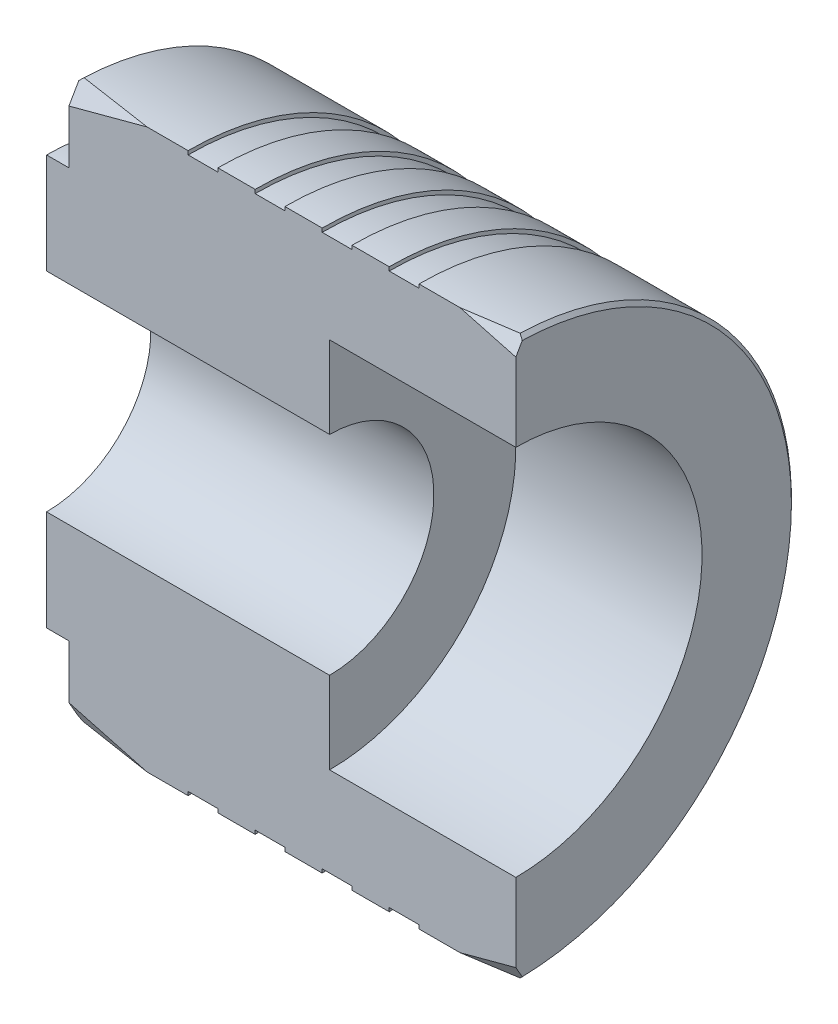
ISO-10303-21;
HEADER;
FILE_DESCRIPTION(('STEP AP214'),'2;1');
FILE_NAME('part.step','',(''),(''),'','','');
FILE_SCHEMA(('AUTOMOTIVE_DESIGN { 1 0 10303 214 1 1 1 1 }'));
ENDSEC;
DATA;
#1=APPLICATION_CONTEXT('core data for automotive mechanical design processes');
#2=APPLICATION_PROTOCOL_DEFINITION('international standard','automotive_design',2000,#1);
#3=PRODUCT_CONTEXT('',#1,'mechanical');
#4=PRODUCT('Part','Part','',(#3));
#5=PRODUCT_RELATED_PRODUCT_CATEGORY('part','',(#4));
#6=PRODUCT_DEFINITION_FORMATION('','',#4);
#7=PRODUCT_DEFINITION_CONTEXT('part definition',#1,'design');
#8=PRODUCT_DEFINITION('design','',#6,#7);
#9=PRODUCT_DEFINITION_SHAPE('','',#8);
#10=(LENGTH_UNIT() NAMED_UNIT(*) SI_UNIT(.MILLI.,.METRE.));
#11=(NAMED_UNIT(*) PLANE_ANGLE_UNIT() SI_UNIT($,.RADIAN.));
#12=(NAMED_UNIT(*) SI_UNIT($,.STERADIAN.) SOLID_ANGLE_UNIT());
#13=UNCERTAINTY_MEASURE_WITH_UNIT(LENGTH_MEASURE(1.E-05),#10,'distance_accuracy_value','');
#14=(GEOMETRIC_REPRESENTATION_CONTEXT(3) GLOBAL_UNCERTAINTY_ASSIGNED_CONTEXT((#13)) GLOBAL_UNIT_ASSIGNED_CONTEXT((#10,
#11,#12)) REPRESENTATION_CONTEXT('',''));
#15=CARTESIAN_POINT('',(0.,0.,0.));
#16=DIRECTION('',(0.,0.,1.));
#17=DIRECTION('',(1.,0.,0.));
#18=AXIS2_PLACEMENT_3D('',#15,#16,#17);
#19=CARTESIAN_POINT('',(0.,0.,0.));
#20=DIRECTION('',(1.,0.,0.));
#21=DIRECTION('',(0.,0.,-1.));
#22=AXIS2_PLACEMENT_3D('',#19,#20,#21);
#23=CYLINDRICAL_SURFACE('',#22,14.);
#24=CARTESIAN_POINT('',(0.,0.,0.));
#25=DIRECTION('',(1.,0.,0.));
#26=DIRECTION('',(0.,0.,-1.));
#27=AXIS2_PLACEMENT_3D('',#24,#25,#26);
#28=CIRCLE('',#27,14.);
#29=CARTESIAN_POINT('',(0.,-14.,0.));
#30=VERTEX_POINT('',#29);
#31=CARTESIAN_POINT('',(0.,14.,0.));
#32=VERTEX_POINT('',#31);
#33=EDGE_CURVE('E255',#30,#32,#28,.T.);
#34=ORIENTED_EDGE('',*,*,#33,.F.);
#35=DIRECTION('',(1.,0.,0.));
#36=VECTOR('',#35,1.);
#37=CARTESIAN_POINT('',(0.,-14.,0.));
#38=LINE('',#37,#36);
#39=CARTESIAN_POINT('',(38.,-14.,0.));
#40=VERTEX_POINT('',#39);
#41=EDGE_CURVE('E449',#30,#40,#38,.T.);
#42=ORIENTED_EDGE('',*,*,#41,.T.);
#43=CARTESIAN_POINT('',(38.,0.,0.));
#44=DIRECTION('',(1.,0.,0.));
#45=DIRECTION('',(0.,0.,-1.));
#46=AXIS2_PLACEMENT_3D('',#43,#44,#45);
#47=CIRCLE('',#46,14.);
#48=CARTESIAN_POINT('',(38.,14.,0.));
#49=VERTEX_POINT('',#48);
#50=EDGE_CURVE('E337',#40,#49,#47,.T.);
#51=ORIENTED_EDGE('',*,*,#50,.T.);
#52=DIRECTION('',(1.,0.,0.));
#53=VECTOR('',#52,1.);
#54=CARTESIAN_POINT('',(0.,14.,0.));
#55=LINE('',#54,#53);
#56=EDGE_CURVE('E45',#49,#32,#55,.F.);
#57=ORIENTED_EDGE('',*,*,#56,.T.);
#58=EDGE_LOOP('',(#34,#42,#51,#57));
#59=FACE_BOUND('',#58,.T.);
#60=ADVANCED_FACE('F29',(#59),#23,.F.);
#61=CARTESIAN_POINT('',(0.,14.,0.));
#62=DIRECTION('',(-1.,0.,0.));
#63=DIRECTION('',(0.,0.,1.));
#64=AXIS2_PLACEMENT_3D('',#61,#62,#63);
#65=PLANE('',#64);
#66=CARTESIAN_POINT('',(0.,0.,0.));
#67=DIRECTION('',(1.,0.,0.));
#68=DIRECTION('',(0.,0.,-1.));
#69=AXIS2_PLACEMENT_3D('',#66,#67,#68);
#70=CIRCLE('',#69,27.5);
#71=CARTESIAN_POINT('',(0.,-27.5,0.));
#72=VERTEX_POINT('',#71);
#73=CARTESIAN_POINT('',(0.,27.5,0.));
#74=VERTEX_POINT('',#73);
#75=EDGE_CURVE('E260',#72,#74,#70,.T.);
#76=ORIENTED_EDGE('',*,*,#75,.F.);
#77=DIRECTION('',(0.,1.,0.));
#78=VECTOR('',#77,1.);
#79=CARTESIAN_POINT('',(0.,14.,0.));
#80=LINE('',#79,#78);
#81=EDGE_CURVE('E325',#72,#30,#80,.T.);
#82=ORIENTED_EDGE('',*,*,#81,.T.);
#83=ORIENTED_EDGE('',*,*,#33,.T.);
#84=EDGE_CURVE('E52',#32,#74,#80,.T.);
#85=ORIENTED_EDGE('',*,*,#84,.T.);
#86=EDGE_LOOP('',(#76,#82,#83,#85));
#87=FACE_BOUND('',#86,.T.);
#88=ADVANCED_FACE('F318',(#87),#65,.T.);
#89=CARTESIAN_POINT('',(0.,0.,0.));
#90=DIRECTION('',(1.,0.,0.));
#91=DIRECTION('',(0.,0.,-1.));
#92=AXIS2_PLACEMENT_3D('',#89,#90,#91);
#93=CYLINDRICAL_SURFACE('',#92,27.5);
#94=CARTESIAN_POINT('',(3.,0.,0.));
#95=DIRECTION('',(1.,0.,0.));
#96=DIRECTION('',(0.,0.,-1.));
#97=AXIS2_PLACEMENT_3D('',#94,#95,#96);
#98=CIRCLE('',#97,27.5);
#99=CARTESIAN_POINT('',(3.,-27.5,0.));
#100=VERTEX_POINT('',#99);
#101=CARTESIAN_POINT('',(3.,27.5,0.));
#102=VERTEX_POINT('',#101);
#103=EDGE_CURVE('E328',#100,#102,#98,.T.);
#104=ORIENTED_EDGE('',*,*,#103,.F.);
#105=DIRECTION('',(1.,0.,0.));
#106=VECTOR('',#105,1.);
#107=CARTESIAN_POINT('',(0.,-27.5,0.));
#108=LINE('',#107,#106);
#109=EDGE_CURVE('E445',#100,#72,#108,.F.);
#110=ORIENTED_EDGE('',*,*,#109,.T.);
#111=ORIENTED_EDGE('',*,*,#75,.T.);
#112=DIRECTION('',(1.,0.,0.));
#113=VECTOR('',#112,1.);
#114=CARTESIAN_POINT('',(0.,27.5,0.));
#115=LINE('',#114,#113);
#116=EDGE_CURVE('E441',#74,#102,#115,.T.);
#117=ORIENTED_EDGE('',*,*,#116,.T.);
#118=EDGE_LOOP('',(#104,#110,#111,#117));
#119=FACE_BOUND('',#118,.T.);
#120=ADVANCED_FACE('F315',(#119),#93,.T.);
#121=CARTESIAN_POINT('',(3.,27.5,0.));
#122=DIRECTION('',(-1.,0.,0.));
#123=DIRECTION('',(0.,0.,1.));
#124=AXIS2_PLACEMENT_3D('',#121,#122,#123);
#125=PLANE('',#124);
#126=DIRECTION('',(0.,-0.866025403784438,-0.500000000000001));
#127=VECTOR('',#126,1.);
#128=CARTESIAN_POINT('',(3.,-34.6865334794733,0.));
#129=LINE('',#128,#127);
#130=CARTESIAN_POINT('',(3.,-34.6865334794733,0.));
#131=VERTEX_POINT('',#130);
#132=CARTESIAN_POINT('',(3.,-36.9763736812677,-1.32203985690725));
#133=VERTEX_POINT('',#132);
#134=EDGE_CURVE('E239',#131,#133,#129,.T.);
#135=ORIENTED_EDGE('',*,*,#134,.F.);
#136=DIRECTION('',(0.,1.,0.));
#137=VECTOR('',#136,1.);
#138=CARTESIAN_POINT('',(3.,27.5,0.));
#139=LINE('',#138,#137);
#140=EDGE_CURVE('E234',#131,#100,#139,.T.);
#141=ORIENTED_EDGE('',*,*,#140,.T.);
#142=ORIENTED_EDGE('',*,*,#103,.T.);
#143=CARTESIAN_POINT('',(3.,34.6865334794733,0.));
#144=VERTEX_POINT('',#143);
#145=EDGE_CURVE('E435',#102,#144,#139,.T.);
#146=ORIENTED_EDGE('',*,*,#145,.T.);
#147=DIRECTION('',(0.,-0.866025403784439,0.499999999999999));
#148=VECTOR('',#147,1.);
#149=CARTESIAN_POINT('',(3.,37.4656574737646,-1.60452798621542));
#150=LINE('',#149,#148);
#151=CARTESIAN_POINT('',(3.,36.9763736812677,-1.32203985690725));
#152=VERTEX_POINT('',#151);
#153=EDGE_CURVE('E296',#152,#144,#150,.T.);
#154=ORIENTED_EDGE('',*,*,#153,.F.);
#155=CARTESIAN_POINT('',(3.,0.,0.));
#156=DIRECTION('',(-1.,0.,0.));
#157=DIRECTION('',(0.,0.,1.));
#158=AXIS2_PLACEMENT_3D('',#155,#156,#157);
#159=CIRCLE('',#158,37.);
#160=EDGE_CURVE('E471',#152,#133,#159,.T.);
#161=ORIENTED_EDGE('',*,*,#160,.T.);
#162=EDGE_LOOP('',(#135,#141,#142,#146,#154,#161));
#163=FACE_BOUND('',#162,.T.);
#164=ADVANCED_FACE('F311',(#163),#125,.T.);
#165=CARTESIAN_POINT('',(0.,0.,0.));
#166=DIRECTION('',(1.,0.,0.));
#167=DIRECTION('',(0.,0.,-1.));
#168=AXIS2_PLACEMENT_3D('',#165,#166,#167);
#169=CYLINDRICAL_SURFACE('',#168,37.5);
#170=CARTESIAN_POINT('',(19.,0.,0.));
#171=DIRECTION('',(1.,0.,0.));
#172=DIRECTION('',(0.,0.,-1.));
#173=AXIS2_PLACEMENT_3D('',#170,#171,#172);
#174=CIRCLE('',#173,37.5);
#175=CARTESIAN_POINT('',(19.,-37.5,0.));
#176=VERTEX_POINT('',#175);
#177=CARTESIAN_POINT('',(19.,37.5,0.));
#178=VERTEX_POINT('',#177);
#179=EDGE_CURVE('E250',#176,#178,#174,.T.);
#180=ORIENTED_EDGE('',*,*,#179,.F.);
#181=DIRECTION('',(1.,0.,0.));
#182=VECTOR('',#181,1.);
#183=CARTESIAN_POINT('',(0.,-37.5,0.));
#184=LINE('',#183,#182);
#185=CARTESIAN_POINT('',(13.4999999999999,-37.5,0.));
#186=VERTEX_POINT('',#185);
#187=EDGE_CURVE('E231',#176,#186,#184,.F.);
#188=ORIENTED_EDGE('',*,*,#187,.T.);
#189=CARTESIAN_POINT('',(-126.451905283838,0.,0.));
#190=DIRECTION('',(0.132788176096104,0.49557221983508,-0.858356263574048));
#191=DIRECTION('',(0.991144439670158,-0.0663940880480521,0.114997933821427));
#192=AXIS2_PLACEMENT_3D('',#189,#190,#191);
#193=ELLIPSE('',#192,282.404662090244,37.5);
#194=CARTESIAN_POINT('',(3.49999999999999,-37.4688157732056,-1.52900116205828));
#195=VERTEX_POINT('',#194);
#196=EDGE_CURVE('E247',#195,#186,#193,.F.);
#197=ORIENTED_EDGE('',*,*,#196,.F.);
#198=CARTESIAN_POINT('',(3.49999999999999,0.,0.));
#199=DIRECTION('',(-1.,0.,0.));
#200=DIRECTION('',(0.,0.,1.));
#201=AXIS2_PLACEMENT_3D('',#198,#199,#200);
#202=CIRCLE('',#201,37.5);
#203=CARTESIAN_POINT('',(3.49991989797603,37.4687546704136,-1.52855059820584));
#204=VERTEX_POINT('',#203);
#205=EDGE_CURVE('E470',#195,#204,#202,.F.);
#206=ORIENTED_EDGE('',*,*,#205,.T.);
#207=CARTESIAN_POINT('',(3.,37.4656574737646,-1.60452798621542));
#208=CARTESIAN_POINT('',(3.65333520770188,37.4696617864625,-1.50576856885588));
#209=CARTESIAN_POINT('',(4.96001461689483,37.4776704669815,-1.30824837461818));
#210=CARTESIAN_POINT('',(6.92001409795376,37.4867567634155,-1.01028137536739));
#211=CARTESIAN_POINT('',(8.53467530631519,37.4924503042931,-0.763779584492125));
#212=CARTESIAN_POINT('',(9.80400351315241,37.4957667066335,-0.569328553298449));
#213=CARTESIAN_POINT('',(10.7280036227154,37.4976529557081,-0.427474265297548));
#214=CARTESIAN_POINT('',(11.6520037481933,37.49900576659,-0.285311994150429));
#215=CARTESIAN_POINT('',(12.4220021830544,37.4996793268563,-0.166581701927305));
#216=CARTESIAN_POINT('',(13.0380010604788,37.4999605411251,-0.071448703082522));
#217=CARTESIAN_POINT('',(13.3460001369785,37.4999868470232,-0.0238162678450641));
#218=CARTESIAN_POINT('',(13.5,37.5,0.));
#219=B_SPLINE_CURVE_WITH_KNOTS('',3,(#207,#208,#209,#210,#211,#212,#213,#214,#215,#216,#217,
#218),.UNSPECIFIED.,.F.,.F.,(4,1,1,1,1,1,1,1,1,4),(0.,0.186660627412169,0.373323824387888,
0.559989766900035,0.647990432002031,0.735991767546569,0.823993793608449,0.911996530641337,
0.955998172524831,1.),.UNSPECIFIED.);
#220=CARTESIAN_POINT('',(13.5,37.5,0.));
#221=VERTEX_POINT('',#220);
#222=EDGE_CURVE('E32',#204,#221,#219,.T.);
#223=ORIENTED_EDGE('',*,*,#222,.T.);
#224=DIRECTION('',(1.,0.,0.));
#225=VECTOR('',#224,1.);
#226=CARTESIAN_POINT('',(0.,37.5,0.));
#227=LINE('',#226,#225);
#228=EDGE_CURVE('E433',#221,#178,#227,.T.);
#229=ORIENTED_EDGE('',*,*,#228,.T.);
#230=EDGE_LOOP('',(#180,#188,#197,#206,#223,#229));
#231=FACE_BOUND('',#230,.T.);
#232=ADVANCED_FACE('F245',(#231),#169,.T.);
#233=CARTESIAN_POINT('',(19.,37.5,0.));
#234=DIRECTION('',(1.,0.,0.));
#235=DIRECTION('',(0.,0.,-1.));
#236=AXIS2_PLACEMENT_3D('',#233,#234,#235);
#237=PLANE('',#236);
#238=ORIENTED_EDGE('',*,*,#179,.T.);
#239=DIRECTION('',(0.,-1.,0.));
#240=VECTOR('',#239,1.);
#241=CARTESIAN_POINT('',(19.,37.5,0.));
#242=LINE('',#241,#240);
#243=CARTESIAN_POINT('',(19.,37.,0.));
#244=VERTEX_POINT('',#243);
#245=EDGE_CURVE('E364',#178,#244,#242,.T.);
#246=ORIENTED_EDGE('',*,*,#245,.T.);
#247=CARTESIAN_POINT('',(19.,0.,0.));
#248=DIRECTION('',(1.,0.,0.));
#249=DIRECTION('',(0.,0.,-1.));
#250=AXIS2_PLACEMENT_3D('',#247,#248,#249);
#251=CIRCLE('',#250,37.);
#252=CARTESIAN_POINT('',(19.,-37.,0.));
#253=VERTEX_POINT('',#252);
#254=EDGE_CURVE('E563',#253,#244,#251,.T.);
#255=ORIENTED_EDGE('',*,*,#254,.F.);
#256=EDGE_CURVE('E368',#253,#176,#242,.T.);
#257=ORIENTED_EDGE('',*,*,#256,.T.);
#258=EDGE_LOOP('',(#238,#246,#255,#257));
#259=FACE_BOUND('',#258,.T.);
#260=ADVANCED_FACE('F310',(#259),#237,.T.);
#261=CARTESIAN_POINT('',(0.,0.,0.));
#262=DIRECTION('',(1.,0.,0.));
#263=DIRECTION('',(0.,0.,-1.));
#264=AXIS2_PLACEMENT_3D('',#261,#262,#263);
#265=CYLINDRICAL_SURFACE('',#264,37.);
#266=CARTESIAN_POINT('',(23.,0.,0.));
#267=DIRECTION('',(1.,0.,0.));
#268=DIRECTION('',(0.,0.,-1.));
#269=AXIS2_PLACEMENT_3D('',#266,#267,#268);
#270=CIRCLE('',#269,37.);
#271=CARTESIAN_POINT('',(23.,-37.,0.));
#272=VERTEX_POINT('',#271);
#273=CARTESIAN_POINT('',(23.,37.,0.));
#274=VERTEX_POINT('',#273);
#275=EDGE_CURVE('E558',#272,#274,#270,.T.);
#276=ORIENTED_EDGE('',*,*,#275,.F.);
#277=DIRECTION('',(1.,0.,0.));
#278=VECTOR('',#277,1.);
#279=CARTESIAN_POINT('',(0.,-37.,0.));
#280=LINE('',#279,#278);
#281=EDGE_CURVE('E381',#272,#253,#280,.F.);
#282=ORIENTED_EDGE('',*,*,#281,.T.);
#283=ORIENTED_EDGE('',*,*,#254,.T.);
#284=DIRECTION('',(1.,0.,0.));
#285=VECTOR('',#284,1.);
#286=CARTESIAN_POINT('',(0.,37.,0.));
#287=LINE('',#286,#285);
#288=EDGE_CURVE('E366',#244,#274,#287,.T.);
#289=ORIENTED_EDGE('',*,*,#288,.T.);
#290=EDGE_LOOP('',(#276,#282,#283,#289));
#291=FACE_BOUND('',#290,.T.);
#292=ADVANCED_FACE('F548',(#291),#265,.T.);
#293=CARTESIAN_POINT('',(23.,37.,0.));
#294=DIRECTION('',(-1.,0.,0.));
#295=DIRECTION('',(0.,0.,1.));
#296=AXIS2_PLACEMENT_3D('',#293,#294,#295);
#297=PLANE('',#296);
#298=CARTESIAN_POINT('',(23.,0.,0.));
#299=DIRECTION('',(1.,0.,0.));
#300=DIRECTION('',(0.,0.,-1.));
#301=AXIS2_PLACEMENT_3D('',#298,#299,#300);
#302=CIRCLE('',#301,37.5);
#303=CARTESIAN_POINT('',(23.,-37.5,0.));
#304=VERTEX_POINT('',#303);
#305=CARTESIAN_POINT('',(23.,37.5,0.));
#306=VERTEX_POINT('',#305);
#307=EDGE_CURVE('E564',#304,#306,#302,.T.);
#308=ORIENTED_EDGE('',*,*,#307,.F.);
#309=DIRECTION('',(0.,1.,0.));
#310=VECTOR('',#309,1.);
#311=CARTESIAN_POINT('',(23.,37.,0.));
#312=LINE('',#311,#310);
#313=EDGE_CURVE('E384',#304,#272,#312,.T.);
#314=ORIENTED_EDGE('',*,*,#313,.T.);
#315=ORIENTED_EDGE('',*,*,#275,.T.);
#316=EDGE_CURVE('E388',#274,#306,#312,.T.);
#317=ORIENTED_EDGE('',*,*,#316,.T.);
#318=EDGE_LOOP('',(#308,#314,#315,#317));
#319=FACE_BOUND('',#318,.T.);
#320=ADVANCED_FACE('F545',(#319),#297,.T.);
#321=CARTESIAN_POINT('',(0.,0.,0.));
#322=DIRECTION('',(1.,0.,0.));
#323=DIRECTION('',(0.,0.,-1.));
#324=AXIS2_PLACEMENT_3D('',#321,#322,#323);
#325=CYLINDRICAL_SURFACE('',#324,37.5);
#326=CARTESIAN_POINT('',(28.,0.,0.));
#327=DIRECTION('',(1.,0.,0.));
#328=DIRECTION('',(0.,0.,-1.));
#329=AXIS2_PLACEMENT_3D('',#326,#327,#328);
#330=CIRCLE('',#329,37.5);
#331=CARTESIAN_POINT('',(28.,-37.5,0.));
#332=VERTEX_POINT('',#331);
#333=CARTESIAN_POINT('',(28.,37.5,0.));
#334=VERTEX_POINT('',#333);
#335=EDGE_CURVE('E568',#332,#334,#330,.T.);
#336=ORIENTED_EDGE('',*,*,#335,.F.);
#337=DIRECTION('',(1.,0.,0.));
#338=VECTOR('',#337,1.);
#339=CARTESIAN_POINT('',(0.,-37.5,0.));
#340=LINE('',#339,#338);
#341=EDGE_CURVE('E387',#332,#304,#340,.F.);
#342=ORIENTED_EDGE('',*,*,#341,.T.);
#343=ORIENTED_EDGE('',*,*,#307,.T.);
#344=DIRECTION('',(1.,0.,0.));
#345=VECTOR('',#344,1.);
#346=CARTESIAN_POINT('',(0.,37.5,0.));
#347=LINE('',#346,#345);
#348=EDGE_CURVE('E575',#306,#334,#347,.T.);
#349=ORIENTED_EDGE('',*,*,#348,.T.);
#350=EDGE_LOOP('',(#336,#342,#343,#349));
#351=FACE_BOUND('',#350,.T.);
#352=ADVANCED_FACE('F541',(#351),#325,.T.);
#353=CARTESIAN_POINT('',(28.,37.5,0.));
#354=DIRECTION('',(1.,0.,0.));
#355=DIRECTION('',(0.,0.,-1.));
#356=AXIS2_PLACEMENT_3D('',#353,#354,#355);
#357=PLANE('',#356);
#358=ORIENTED_EDGE('',*,*,#335,.T.);
#359=DIRECTION('',(0.,-1.,0.));
#360=VECTOR('',#359,1.);
#361=CARTESIAN_POINT('',(28.,37.5,0.));
#362=LINE('',#361,#360);
#363=CARTESIAN_POINT('',(28.,37.,0.));
#364=VERTEX_POINT('',#363);
#365=EDGE_CURVE('E395',#334,#364,#362,.T.);
#366=ORIENTED_EDGE('',*,*,#365,.T.);
#367=CARTESIAN_POINT('',(28.,0.,0.));
#368=DIRECTION('',(1.,0.,0.));
#369=DIRECTION('',(0.,0.,-1.));
#370=AXIS2_PLACEMENT_3D('',#367,#368,#369);
#371=CIRCLE('',#370,37.);
#372=CARTESIAN_POINT('',(28.,-37.,0.));
#373=VERTEX_POINT('',#372);
#374=EDGE_CURVE('E800',#373,#364,#371,.T.);
#375=ORIENTED_EDGE('',*,*,#374,.F.);
#376=EDGE_CURVE('E391',#373,#332,#362,.T.);
#377=ORIENTED_EDGE('',*,*,#376,.T.);
#378=EDGE_LOOP('',(#358,#366,#375,#377));
#379=FACE_BOUND('',#378,.T.);
#380=ADVANCED_FACE('F537',(#379),#357,.T.);
#381=CARTESIAN_POINT('',(0.,0.,0.));
#382=DIRECTION('',(1.,0.,0.));
#383=DIRECTION('',(0.,0.,-1.));
#384=AXIS2_PLACEMENT_3D('',#381,#382,#383);
#385=CYLINDRICAL_SURFACE('',#384,37.);
#386=CARTESIAN_POINT('',(32.,0.,0.));
#387=DIRECTION('',(1.,0.,0.));
#388=DIRECTION('',(0.,0.,-1.));
#389=AXIS2_PLACEMENT_3D('',#386,#387,#388);
#390=CIRCLE('',#389,37.);
#391=CARTESIAN_POINT('',(32.,-37.,0.));
#392=VERTEX_POINT('',#391);
#393=CARTESIAN_POINT('',(32.,37.,0.));
#394=VERTEX_POINT('',#393);
#395=EDGE_CURVE('E797',#392,#394,#390,.T.);
#396=ORIENTED_EDGE('',*,*,#395,.F.);
#397=DIRECTION('',(1.,0.,0.));
#398=VECTOR('',#397,1.);
#399=CARTESIAN_POINT('',(0.,-37.,0.));
#400=LINE('',#399,#398);
#401=EDGE_CURVE('E394',#392,#373,#400,.F.);
#402=ORIENTED_EDGE('',*,*,#401,.T.);
#403=ORIENTED_EDGE('',*,*,#374,.T.);
#404=DIRECTION('',(1.,0.,0.));
#405=VECTOR('',#404,1.);
#406=CARTESIAN_POINT('',(0.,37.,0.));
#407=LINE('',#406,#405);
#408=EDGE_CURVE('E579',#364,#394,#407,.T.);
#409=ORIENTED_EDGE('',*,*,#408,.T.);
#410=EDGE_LOOP('',(#396,#402,#403,#409));
#411=FACE_BOUND('',#410,.T.);
#412=ADVANCED_FACE('F533',(#411),#385,.T.);
#413=CARTESIAN_POINT('',(32.,37.,0.));
#414=DIRECTION('',(-1.,0.,0.));
#415=DIRECTION('',(0.,0.,1.));
#416=AXIS2_PLACEMENT_3D('',#413,#414,#415);
#417=PLANE('',#416);
#418=CARTESIAN_POINT('',(32.,0.,0.));
#419=DIRECTION('',(1.,0.,0.));
#420=DIRECTION('',(0.,0.,-1.));
#421=AXIS2_PLACEMENT_3D('',#418,#419,#420);
#422=CIRCLE('',#421,37.5);
#423=CARTESIAN_POINT('',(32.,-37.5,0.));
#424=VERTEX_POINT('',#423);
#425=CARTESIAN_POINT('',(32.,37.5,0.));
#426=VERTEX_POINT('',#425);
#427=EDGE_CURVE('E794',#424,#426,#422,.T.);
#428=ORIENTED_EDGE('',*,*,#427,.F.);
#429=DIRECTION('',(0.,1.,0.));
#430=VECTOR('',#429,1.);
#431=CARTESIAN_POINT('',(32.,37.,0.));
#432=LINE('',#431,#430);
#433=EDGE_CURVE('E398',#424,#392,#432,.T.);
#434=ORIENTED_EDGE('',*,*,#433,.T.);
#435=ORIENTED_EDGE('',*,*,#395,.T.);
#436=EDGE_CURVE('E402',#394,#426,#432,.T.);
#437=ORIENTED_EDGE('',*,*,#436,.T.);
#438=EDGE_LOOP('',(#428,#434,#435,#437));
#439=FACE_BOUND('',#438,.T.);
#440=ADVANCED_FACE('F529',(#439),#417,.T.);
#441=CARTESIAN_POINT('',(0.,0.,0.));
#442=DIRECTION('',(1.,0.,0.));
#443=DIRECTION('',(0.,0.,-1.));
#444=AXIS2_PLACEMENT_3D('',#441,#442,#443);
#445=CYLINDRICAL_SURFACE('',#444,37.5);
#446=CARTESIAN_POINT('',(37.,0.,0.));
#447=DIRECTION('',(1.,0.,0.));
#448=DIRECTION('',(0.,0.,-1.));
#449=AXIS2_PLACEMENT_3D('',#446,#447,#448);
#450=CIRCLE('',#449,37.5);
#451=CARTESIAN_POINT('',(37.,-37.5,0.));
#452=VERTEX_POINT('',#451);
#453=CARTESIAN_POINT('',(37.,37.5,0.));
#454=VERTEX_POINT('',#453);
#455=EDGE_CURVE('E791',#452,#454,#450,.T.);
#456=ORIENTED_EDGE('',*,*,#455,.F.);
#457=DIRECTION('',(1.,0.,0.));
#458=VECTOR('',#457,1.);
#459=CARTESIAN_POINT('',(0.,-37.5,0.));
#460=LINE('',#459,#458);
#461=EDGE_CURVE('E401',#452,#424,#460,.F.);
#462=ORIENTED_EDGE('',*,*,#461,.T.);
#463=ORIENTED_EDGE('',*,*,#427,.T.);
#464=DIRECTION('',(1.,0.,0.));
#465=VECTOR('',#464,1.);
#466=CARTESIAN_POINT('',(0.,37.5,0.));
#467=LINE('',#466,#465);
#468=EDGE_CURVE('E582',#426,#454,#467,.T.);
#469=ORIENTED_EDGE('',*,*,#468,.T.);
#470=EDGE_LOOP('',(#456,#462,#463,#469));
#471=FACE_BOUND('',#470,.T.);
#472=ADVANCED_FACE('F525',(#471),#445,.T.);
#473=CARTESIAN_POINT('',(37.,37.5,0.));
#474=DIRECTION('',(1.,0.,0.));
#475=DIRECTION('',(0.,0.,-1.));
#476=AXIS2_PLACEMENT_3D('',#473,#474,#475);
#477=PLANE('',#476);
#478=ORIENTED_EDGE('',*,*,#455,.T.);
#479=DIRECTION('',(0.,-1.,0.));
#480=VECTOR('',#479,1.);
#481=CARTESIAN_POINT('',(37.,37.5,0.));
#482=LINE('',#481,#480);
#483=CARTESIAN_POINT('',(37.,37.,0.));
#484=VERTEX_POINT('',#483);
#485=EDGE_CURVE('E409',#454,#484,#482,.T.);
#486=ORIENTED_EDGE('',*,*,#485,.T.);
#487=CARTESIAN_POINT('',(37.,0.,0.));
#488=DIRECTION('',(1.,0.,0.));
#489=DIRECTION('',(0.,0.,-1.));
#490=AXIS2_PLACEMENT_3D('',#487,#488,#489);
#491=CIRCLE('',#490,37.);
#492=CARTESIAN_POINT('',(37.,-37.,0.));
#493=VERTEX_POINT('',#492);
#494=EDGE_CURVE('E788',#493,#484,#491,.T.);
#495=ORIENTED_EDGE('',*,*,#494,.F.);
#496=EDGE_CURVE('E405',#493,#452,#482,.T.);
#497=ORIENTED_EDGE('',*,*,#496,.T.);
#498=EDGE_LOOP('',(#478,#486,#495,#497));
#499=FACE_BOUND('',#498,.T.);
#500=ADVANCED_FACE('F521',(#499),#477,.T.);
#501=CARTESIAN_POINT('',(0.,0.,0.));
#502=DIRECTION('',(1.,0.,0.));
#503=DIRECTION('',(0.,0.,-1.));
#504=AXIS2_PLACEMENT_3D('',#501,#502,#503);
#505=CYLINDRICAL_SURFACE('',#504,37.);
#506=CARTESIAN_POINT('',(41.,0.,0.));
#507=DIRECTION('',(1.,0.,0.));
#508=DIRECTION('',(0.,0.,-1.));
#509=AXIS2_PLACEMENT_3D('',#506,#507,#508);
#510=CIRCLE('',#509,37.);
#511=CARTESIAN_POINT('',(41.,-37.,0.));
#512=VERTEX_POINT('',#511);
#513=CARTESIAN_POINT('',(41.,37.,0.));
#514=VERTEX_POINT('',#513);
#515=EDGE_CURVE('E785',#512,#514,#510,.T.);
#516=ORIENTED_EDGE('',*,*,#515,.F.);
#517=DIRECTION('',(1.,0.,0.));
#518=VECTOR('',#517,1.);
#519=CARTESIAN_POINT('',(0.,-37.,0.));
#520=LINE('',#519,#518);
#521=EDGE_CURVE('E408',#512,#493,#520,.F.);
#522=ORIENTED_EDGE('',*,*,#521,.T.);
#523=ORIENTED_EDGE('',*,*,#494,.T.);
#524=DIRECTION('',(1.,0.,0.));
#525=VECTOR('',#524,1.);
#526=CARTESIAN_POINT('',(0.,37.,0.));
#527=LINE('',#526,#525);
#528=EDGE_CURVE('E584',#484,#514,#527,.T.);
#529=ORIENTED_EDGE('',*,*,#528,.T.);
#530=EDGE_LOOP('',(#516,#522,#523,#529));
#531=FACE_BOUND('',#530,.T.);
#532=ADVANCED_FACE('F517',(#531),#505,.T.);
#533=CARTESIAN_POINT('',(41.,37.,0.));
#534=DIRECTION('',(-1.,0.,0.));
#535=DIRECTION('',(0.,0.,1.));
#536=AXIS2_PLACEMENT_3D('',#533,#534,#535);
#537=PLANE('',#536);
#538=CARTESIAN_POINT('',(41.,0.,0.));
#539=DIRECTION('',(1.,0.,0.));
#540=DIRECTION('',(0.,0.,-1.));
#541=AXIS2_PLACEMENT_3D('',#538,#539,#540);
#542=CIRCLE('',#541,37.5);
#543=CARTESIAN_POINT('',(41.,-37.5,0.));
#544=VERTEX_POINT('',#543);
#545=CARTESIAN_POINT('',(41.,37.5,0.));
#546=VERTEX_POINT('',#545);
#547=EDGE_CURVE('E782',#544,#546,#542,.T.);
#548=ORIENTED_EDGE('',*,*,#547,.F.);
#549=DIRECTION('',(0.,1.,0.));
#550=VECTOR('',#549,1.);
#551=CARTESIAN_POINT('',(41.,37.,0.));
#552=LINE('',#551,#550);
#553=EDGE_CURVE('E412',#544,#512,#552,.T.);
#554=ORIENTED_EDGE('',*,*,#553,.T.);
#555=ORIENTED_EDGE('',*,*,#515,.T.);
#556=EDGE_CURVE('E416',#514,#546,#552,.T.);
#557=ORIENTED_EDGE('',*,*,#556,.T.);
#558=EDGE_LOOP('',(#548,#554,#555,#557));
#559=FACE_BOUND('',#558,.T.);
#560=ADVANCED_FACE('F513',(#559),#537,.T.);
#561=CARTESIAN_POINT('',(0.,0.,0.));
#562=DIRECTION('',(1.,0.,0.));
#563=DIRECTION('',(0.,0.,-1.));
#564=AXIS2_PLACEMENT_3D('',#561,#562,#563);
#565=CYLINDRICAL_SURFACE('',#564,37.5);
#566=CARTESIAN_POINT('',(46.,0.,0.));
#567=DIRECTION('',(1.,0.,0.));
#568=DIRECTION('',(0.,0.,-1.));
#569=AXIS2_PLACEMENT_3D('',#566,#567,#568);
#570=CIRCLE('',#569,37.5);
#571=CARTESIAN_POINT('',(46.,-37.5,0.));
#572=VERTEX_POINT('',#571);
#573=CARTESIAN_POINT('',(46.,37.5,0.));
#574=VERTEX_POINT('',#573);
#575=EDGE_CURVE('E779',#572,#574,#570,.T.);
#576=ORIENTED_EDGE('',*,*,#575,.F.);
#577=DIRECTION('',(1.,0.,0.));
#578=VECTOR('',#577,1.);
#579=CARTESIAN_POINT('',(0.,-37.5,0.));
#580=LINE('',#579,#578);
#581=EDGE_CURVE('E415',#572,#544,#580,.F.);
#582=ORIENTED_EDGE('',*,*,#581,.T.);
#583=ORIENTED_EDGE('',*,*,#547,.T.);
#584=DIRECTION('',(1.,0.,0.));
#585=VECTOR('',#584,1.);
#586=CARTESIAN_POINT('',(0.,37.5,0.));
#587=LINE('',#586,#585);
#588=EDGE_CURVE('E586',#546,#574,#587,.T.);
#589=ORIENTED_EDGE('',*,*,#588,.T.);
#590=EDGE_LOOP('',(#576,#582,#583,#589));
#591=FACE_BOUND('',#590,.T.);
#592=ADVANCED_FACE('F509',(#591),#565,.T.);
#593=CARTESIAN_POINT('',(46.,37.5,0.));
#594=DIRECTION('',(1.,0.,0.));
#595=DIRECTION('',(0.,0.,-1.));
#596=AXIS2_PLACEMENT_3D('',#593,#594,#595);
#597=PLANE('',#596);
#598=ORIENTED_EDGE('',*,*,#575,.T.);
#599=DIRECTION('',(0.,-1.,0.));
#600=VECTOR('',#599,1.);
#601=CARTESIAN_POINT('',(46.,37.5,0.));
#602=LINE('',#601,#600);
#603=CARTESIAN_POINT('',(46.,37.,0.));
#604=VERTEX_POINT('',#603);
#605=EDGE_CURVE('E423',#574,#604,#602,.T.);
#606=ORIENTED_EDGE('',*,*,#605,.T.);
#607=CARTESIAN_POINT('',(46.,0.,0.));
#608=DIRECTION('',(1.,0.,0.));
#609=DIRECTION('',(0.,0.,-1.));
#610=AXIS2_PLACEMENT_3D('',#607,#608,#609);
#611=CIRCLE('',#610,37.);
#612=CARTESIAN_POINT('',(46.,-37.,0.));
#613=VERTEX_POINT('',#612);
#614=EDGE_CURVE('E776',#613,#604,#611,.T.);
#615=ORIENTED_EDGE('',*,*,#614,.F.);
#616=EDGE_CURVE('E419',#613,#572,#602,.T.);
#617=ORIENTED_EDGE('',*,*,#616,.T.);
#618=EDGE_LOOP('',(#598,#606,#615,#617));
#619=FACE_BOUND('',#618,.T.);
#620=ADVANCED_FACE('F505',(#619),#597,.T.);
#621=CARTESIAN_POINT('',(0.,0.,0.));
#622=DIRECTION('',(1.,0.,0.));
#623=DIRECTION('',(0.,0.,-1.));
#624=AXIS2_PLACEMENT_3D('',#621,#622,#623);
#625=CYLINDRICAL_SURFACE('',#624,37.);
#626=CARTESIAN_POINT('',(50.,0.,0.));
#627=DIRECTION('',(1.,0.,0.));
#628=DIRECTION('',(0.,0.,-1.));
#629=AXIS2_PLACEMENT_3D('',#626,#627,#628);
#630=CIRCLE('',#629,37.);
#631=CARTESIAN_POINT('',(50.,-37.,0.));
#632=VERTEX_POINT('',#631);
#633=CARTESIAN_POINT('',(50.,37.,0.));
#634=VERTEX_POINT('',#633);
#635=EDGE_CURVE('E773',#632,#634,#630,.T.);
#636=ORIENTED_EDGE('',*,*,#635,.F.);
#637=DIRECTION('',(1.,0.,0.));
#638=VECTOR('',#637,1.);
#639=CARTESIAN_POINT('',(0.,-37.,0.));
#640=LINE('',#639,#638);
#641=EDGE_CURVE('E422',#632,#613,#640,.F.);
#642=ORIENTED_EDGE('',*,*,#641,.T.);
#643=ORIENTED_EDGE('',*,*,#614,.T.);
#644=DIRECTION('',(1.,0.,0.));
#645=VECTOR('',#644,1.);
#646=CARTESIAN_POINT('',(0.,37.,0.));
#647=LINE('',#646,#645);
#648=EDGE_CURVE('E588',#604,#634,#647,.T.);
#649=ORIENTED_EDGE('',*,*,#648,.T.);
#650=EDGE_LOOP('',(#636,#642,#643,#649));
#651=FACE_BOUND('',#650,.T.);
#652=ADVANCED_FACE('F501',(#651),#625,.T.);
#653=CARTESIAN_POINT('',(50.,37.,0.));
#654=DIRECTION('',(-1.,0.,0.));
#655=DIRECTION('',(0.,0.,1.));
#656=AXIS2_PLACEMENT_3D('',#653,#654,#655);
#657=PLANE('',#656);
#658=CARTESIAN_POINT('',(50.,0.,0.));
#659=DIRECTION('',(1.,0.,0.));
#660=DIRECTION('',(0.,0.,-1.));
#661=AXIS2_PLACEMENT_3D('',#658,#659,#660);
#662=CIRCLE('',#661,37.5);
#663=CARTESIAN_POINT('',(50.,-37.5,0.));
#664=VERTEX_POINT('',#663);
#665=CARTESIAN_POINT('',(50.,37.5,0.));
#666=VERTEX_POINT('',#665);
#667=EDGE_CURVE('E768',#664,#666,#662,.T.);
#668=ORIENTED_EDGE('',*,*,#667,.F.);
#669=DIRECTION('',(0.,1.,0.));
#670=VECTOR('',#669,1.);
#671=CARTESIAN_POINT('',(50.,37.,0.));
#672=LINE('',#671,#670);
#673=EDGE_CURVE('E426',#664,#632,#672,.T.);
#674=ORIENTED_EDGE('',*,*,#673,.T.);
#675=ORIENTED_EDGE('',*,*,#635,.T.);
#676=EDGE_CURVE('E430',#634,#666,#672,.T.);
#677=ORIENTED_EDGE('',*,*,#676,.T.);
#678=EDGE_LOOP('',(#668,#674,#675,#677));
#679=FACE_BOUND('',#678,.T.);
#680=ADVANCED_FACE('F498',(#679),#657,.T.);
#681=CARTESIAN_POINT('',(0.,0.,0.));
#682=DIRECTION('',(1.,0.,0.));
#683=DIRECTION('',(0.,0.,-1.));
#684=AXIS2_PLACEMENT_3D('',#681,#682,#683);
#685=CYLINDRICAL_SURFACE('',#684,37.5);
#686=CARTESIAN_POINT('',(55.5000000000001,-37.5,0.));
#687=CARTESIAN_POINT('',(55.8076471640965,-37.4999999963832,-0.0475931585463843));
#688=CARTESIAN_POINT('',(56.115302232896,-37.4999093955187,-0.0951352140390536));
#689=CARTESIAN_POINT('',(56.7319965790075,-37.499547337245,-0.190329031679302));
#690=CARTESIAN_POINT('',(57.0410359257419,-37.499275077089,-0.237980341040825));
#691=CARTESIAN_POINT('',(57.6604988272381,-37.4985484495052,-0.333391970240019));
#692=CARTESIAN_POINT('',(57.9709224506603,-37.4980932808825,-0.38115183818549));
#693=CARTESIAN_POINT('',(58.5931539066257,-37.4969995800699,-0.476779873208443));
#694=CARTESIAN_POINT('',(58.9049618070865,-37.4963602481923,-0.524647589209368));
#695=CARTESIAN_POINT('',(59.5299618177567,-37.4948969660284,-0.620490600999));
#696=CARTESIAN_POINT('',(59.8431539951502,-37.4940722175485,-0.668465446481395));
#697=CARTESIAN_POINT('',(60.4709225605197,-37.4922368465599,-0.764521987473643));
#698=CARTESIAN_POINT('',(60.7854990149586,-37.4912254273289,-0.812603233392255));
#699=CARTESIAN_POINT('',(61.4160361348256,-37.4890154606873,-0.90887183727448));
#700=CARTESIAN_POINT('',(61.7319968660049,-37.4878161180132,-0.957058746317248));
#701=CARTESIAN_POINT('',(62.3653025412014,-37.4852290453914,-1.05353792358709));
#702=CARTESIAN_POINT('',(62.6826475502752,-37.483840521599,-1.10182974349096));
#703=CARTESIAN_POINT('',(63.,-37.4823603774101,-1.15006979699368));
#704=B_SPLINE_CURVE_WITH_KNOTS('',3,(#686,#687,#688,#689,#690,#691,#692,#693,#694,#695,#696,
#697,#698,#699,#700,#701,#702,#703),.UNSPECIFIED.,.F.,.F.,(4,2,2,2,2,2,2,2,4),(0.,
0.933920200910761,1.87199494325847,2.8142243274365,3.760608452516,4.71114741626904,
5.66584131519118,6.62469024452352,7.58769429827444),.UNSPECIFIED.);
#705=CARTESIAN_POINT('',(62.5,-37.4846165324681,-1.07402207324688));
#706=VERTEX_POINT('',#705);
#707=CARTESIAN_POINT('',(55.5,-37.5,0.));
#708=VERTEX_POINT('',#707);
#709=EDGE_CURVE('E286',#706,#708,#704,.F.);
#710=ORIENTED_EDGE('',*,*,#709,.T.);
#711=DIRECTION('',(1.,0.,0.));
#712=VECTOR('',#711,1.);
#713=CARTESIAN_POINT('',(0.,-37.5,0.));
#714=LINE('',#713,#712);
#715=EDGE_CURVE('E429',#708,#664,#714,.F.);
#716=ORIENTED_EDGE('',*,*,#715,.T.);
#717=ORIENTED_EDGE('',*,*,#667,.T.);
#718=DIRECTION('',(1.,0.,0.));
#719=VECTOR('',#718,1.);
#720=CARTESIAN_POINT('',(0.,37.5,0.));
#721=LINE('',#720,#719);
#722=CARTESIAN_POINT('',(55.5000000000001,37.5,0.));
#723=VERTEX_POINT('',#722);
#724=EDGE_CURVE('E240',#666,#723,#721,.T.);
#725=ORIENTED_EDGE('',*,*,#724,.T.);
#726=CARTESIAN_POINT('',(195.451905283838,0.,0.));
#727=DIRECTION('',(-0.132788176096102,-0.495572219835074,-0.858356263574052));
#728=DIRECTION('',(0.991144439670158,-0.0663940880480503,-0.114997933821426));
#729=AXIS2_PLACEMENT_3D('',#726,#727,#728);
#730=ELLIPSE('',#729,282.404662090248,37.5);
#731=CARTESIAN_POINT('',(62.4999999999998,37.4846165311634,-1.07402211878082));
#732=VERTEX_POINT('',#731);
#733=EDGE_CURVE('E285',#732,#723,#730,.F.);
#734=ORIENTED_EDGE('',*,*,#733,.F.);
#735=CARTESIAN_POINT('',(62.5,0.,0.));
#736=DIRECTION('',(1.,0.,0.));
#737=DIRECTION('',(0.,0.,-1.));
#738=AXIS2_PLACEMENT_3D('',#735,#736,#737);
#739=CIRCLE('',#738,37.5);
#740=EDGE_CURVE('E258',#732,#706,#739,.F.);
#741=ORIENTED_EDGE('',*,*,#740,.T.);
#742=EDGE_LOOP('',(#710,#716,#717,#725,#734,#741));
#743=FACE_BOUND('',#742,.T.);
#744=ADVANCED_FACE('F494',(#743),#685,.T.);
#745=CARTESIAN_POINT('',(63.,37.5,0.));
#746=DIRECTION('',(1.,0.,0.));
#747=DIRECTION('',(0.,0.,-1.));
#748=AXIS2_PLACEMENT_3D('',#745,#746,#747);
#749=PLANE('',#748);
#750=DIRECTION('',(0.,0.866025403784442,-0.499999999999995));
#751=VECTOR('',#750,1.);
#752=CARTESIAN_POINT('',(63.,35.4903810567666,0.));
#753=LINE('',#752,#751);
#754=CARTESIAN_POINT('',(63.,35.4903810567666,0.));
#755=VERTEX_POINT('',#754);
#756=CARTESIAN_POINT('',(63.,36.9898703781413,-0.865730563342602));
#757=VERTEX_POINT('',#756);
#758=EDGE_CURVE('E334',#755,#757,#753,.T.);
#759=ORIENTED_EDGE('',*,*,#758,.F.);
#760=DIRECTION('',(0.,-1.,0.));
#761=VECTOR('',#760,1.);
#762=CARTESIAN_POINT('',(63.,37.5,0.));
#763=LINE('',#762,#761);
#764=CARTESIAN_POINT('',(63.,25.,0.));
#765=VERTEX_POINT('',#764);
#766=EDGE_CURVE('E358',#755,#765,#763,.T.);
#767=ORIENTED_EDGE('',*,*,#766,.T.);
#768=CARTESIAN_POINT('',(63.,0.,0.));
#769=DIRECTION('',(1.,0.,0.));
#770=DIRECTION('',(0.,0.,-1.));
#771=AXIS2_PLACEMENT_3D('',#768,#769,#770);
#772=CIRCLE('',#771,25.);
#773=CARTESIAN_POINT('',(63.,-25.,0.));
#774=VERTEX_POINT('',#773);
#775=EDGE_CURVE('E462',#774,#765,#772,.T.);
#776=ORIENTED_EDGE('',*,*,#775,.F.);
#777=CARTESIAN_POINT('',(63.,-35.4903810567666,0.));
#778=VERTEX_POINT('',#777);
#779=EDGE_CURVE('E377',#774,#778,#763,.T.);
#780=ORIENTED_EDGE('',*,*,#779,.T.);
#781=DIRECTION('',(0.,0.866025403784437,0.500000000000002));
#782=VECTOR('',#781,1.);
#783=CARTESIAN_POINT('',(63.,-35.4903810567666,0.));
#784=LINE('',#783,#782);
#785=CARTESIAN_POINT('',(63.,-36.9898703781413,-0.865730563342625));
#786=VERTEX_POINT('',#785);
#787=EDGE_CURVE('E282',#786,#778,#784,.T.);
#788=ORIENTED_EDGE('',*,*,#787,.F.);
#789=CARTESIAN_POINT('',(63.,0.,0.));
#790=DIRECTION('',(1.,0.,0.));
#791=DIRECTION('',(0.,0.,-1.));
#792=AXIS2_PLACEMENT_3D('',#789,#790,#791);
#793=CIRCLE('',#792,37.);
#794=EDGE_CURVE('E254',#786,#757,#793,.T.);
#795=ORIENTED_EDGE('',*,*,#794,.T.);
#796=EDGE_LOOP('',(#759,#767,#776,#780,#788,#795));
#797=FACE_BOUND('',#796,.T.);
#798=ADVANCED_FACE('F460',(#797),#749,.T.);
#799=CARTESIAN_POINT('',(0.,0.,0.));
#800=DIRECTION('',(1.,0.,0.));
#801=DIRECTION('',(0.,0.,-1.));
#802=AXIS2_PLACEMENT_3D('',#799,#800,#801);
#803=CYLINDRICAL_SURFACE('',#802,25.);
#804=CARTESIAN_POINT('',(38.,0.,0.));
#805=DIRECTION('',(1.,0.,0.));
#806=DIRECTION('',(0.,0.,-1.));
#807=AXIS2_PLACEMENT_3D('',#804,#805,#806);
#808=CIRCLE('',#807,25.);
#809=CARTESIAN_POINT('',(38.,-25.,0.));
#810=VERTEX_POINT('',#809);
#811=CARTESIAN_POINT('',(38.,25.,0.));
#812=VERTEX_POINT('',#811);
#813=EDGE_CURVE('E767',#810,#812,#808,.T.);
#814=ORIENTED_EDGE('',*,*,#813,.F.);
#815=DIRECTION('',(1.,0.,0.));
#816=VECTOR('',#815,1.);
#817=CARTESIAN_POINT('',(0.,-25.,0.));
#818=LINE('',#817,#816);
#819=EDGE_CURVE('E454',#810,#774,#818,.T.);
#820=ORIENTED_EDGE('',*,*,#819,.T.);
#821=ORIENTED_EDGE('',*,*,#775,.T.);
#822=DIRECTION('',(1.,0.,0.));
#823=VECTOR('',#822,1.);
#824=CARTESIAN_POINT('',(0.,25.,0.));
#825=LINE('',#824,#823);
#826=EDGE_CURVE('E360',#765,#812,#825,.F.);
#827=ORIENTED_EDGE('',*,*,#826,.T.);
#828=EDGE_LOOP('',(#814,#820,#821,#827));
#829=FACE_BOUND('',#828,.T.);
#830=ADVANCED_FACE('F489',(#829),#803,.F.);
#831=CARTESIAN_POINT('',(38.,25.,0.));
#832=DIRECTION('',(1.,0.,0.));
#833=DIRECTION('',(0.,0.,-1.));
#834=AXIS2_PLACEMENT_3D('',#831,#832,#833);
#835=PLANE('',#834);
#836=ORIENTED_EDGE('',*,*,#813,.T.);
#837=DIRECTION('',(0.,-1.,0.));
#838=VECTOR('',#837,1.);
#839=CARTESIAN_POINT('',(38.,25.,0.));
#840=LINE('',#839,#838);
#841=EDGE_CURVE('E369',#812,#49,#840,.T.);
#842=ORIENTED_EDGE('',*,*,#841,.T.);
#843=ORIENTED_EDGE('',*,*,#50,.F.);
#844=EDGE_CURVE('E452',#40,#810,#840,.T.);
#845=ORIENTED_EDGE('',*,*,#844,.T.);
#846=EDGE_LOOP('',(#836,#842,#843,#845));
#847=FACE_BOUND('',#846,.T.);
#848=ADVANCED_FACE('F484',(#847),#835,.T.);
#849=CARTESIAN_POINT('',(63.,37.4823603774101,-1.15006979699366));
#850=DIRECTION('',(-0.132788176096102,-0.495572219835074,-0.858356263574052));
#851=DIRECTION('',(0.,-0.866025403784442,0.499999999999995));
#852=AXIS2_PLACEMENT_3D('',#849,#850,#851);
#853=PLANE('',#852);
#854=ORIENTED_EDGE('',*,*,#758,.T.);
#855=CARTESIAN_POINT('',(63.,36.9898703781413,-0.865730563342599));
#856=CARTESIAN_POINT('',(62.9167147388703,37.072364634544,-0.900474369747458));
#857=CARTESIAN_POINT('',(62.8334054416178,37.1548406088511,-0.935203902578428));
#858=CARTESIAN_POINT('',(62.6667387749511,37.3197559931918,-1.00463442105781));
#859=CARTESIAN_POINT('',(62.5833814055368,37.4021954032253,-1.03933540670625));
#860=CARTESIAN_POINT('',(62.5,37.4846165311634,-1.07402211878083));
#861=B_SPLINE_CURVE_WITH_KNOTS('',3,(#855,#856,#857,#858,#859,#860),.UNSPECIFIED.,.F.,.F.,(4,2,
4),(0.,0.366796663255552,0.73359332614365),.UNSPECIFIED.);
#862=EDGE_CURVE('E349',#757,#732,#861,.T.);
#863=ORIENTED_EDGE('',*,*,#862,.T.);
#864=ORIENTED_EDGE('',*,*,#733,.T.);
#865=DIRECTION('',(0.965925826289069,-0.258819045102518,0.));
#866=VECTOR('',#865,1.);
#867=CARTESIAN_POINT('',(59.2499420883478,36.4952060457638,0.));
#868=LINE('',#867,#866);
#869=EDGE_CURVE('E338',#723,#755,#868,.T.);
#870=ORIENTED_EDGE('',*,*,#869,.T.);
#871=EDGE_LOOP('',(#854,#863,#864,#870));
#872=FACE_BOUND('',#871,.T.);
#873=ADVANCED_FACE('F347',(#872),#853,.F.);
#874=CARTESIAN_POINT('',(63.,-35.4903810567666,0.));
#875=DIRECTION('',(-0.132788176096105,0.49557221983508,-0.858356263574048));
#876=DIRECTION('',(0.,-0.866025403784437,-0.500000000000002));
#877=AXIS2_PLACEMENT_3D('',#874,#875,#876);
#878=PLANE('',#877);
#879=ORIENTED_EDGE('',*,*,#709,.F.);
#880=CARTESIAN_POINT('',(62.5,-37.4846165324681,-1.07402207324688));
#881=CARTESIAN_POINT('',(62.5833814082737,-37.4021954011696,-1.03933538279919));
#882=CARTESIAN_POINT('',(62.6667387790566,-37.3197559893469,-1.00463441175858));
#883=CARTESIAN_POINT('',(62.8334054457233,-37.1548406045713,-0.935203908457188));
#884=CARTESIAN_POINT('',(62.9167147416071,-37.0723646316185,-0.900474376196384));
#885=CARTESIAN_POINT('',(63.,-36.9898703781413,-0.865730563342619));
#886=B_SPLINE_CURVE_WITH_KNOTS('',3,(#880,#881,#882,#883,#884,#885),.UNSPECIFIED.,.F.,.F.,(4,2,
4),(0.,0.366796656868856,0.733593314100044),.UNSPECIFIED.);
#887=EDGE_CURVE('E265',#706,#786,#886,.T.);
#888=ORIENTED_EDGE('',*,*,#887,.T.);
#889=ORIENTED_EDGE('',*,*,#787,.T.);
#890=DIRECTION('',(0.965925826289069,0.258819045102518,0.));
#891=VECTOR('',#890,1.);
#892=CARTESIAN_POINT('',(59.2499420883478,-36.4952060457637,0.));
#893=LINE('',#892,#891);
#894=EDGE_CURVE('E294',#708,#778,#893,.T.);
#895=ORIENTED_EDGE('',*,*,#894,.F.);
#896=EDGE_LOOP('',(#879,#888,#889,#895));
#897=FACE_BOUND('',#896,.T.);
#898=ADVANCED_FACE('F466',(#897),#878,.F.);
#899=CARTESIAN_POINT('',(3.,34.6865334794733,0.));
#900=DIRECTION('',(0.132788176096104,-0.495572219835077,-0.85835626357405));
#901=DIRECTION('',(0.,0.866025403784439,-0.499999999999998));
#902=AXIS2_PLACEMENT_3D('',#899,#900,#901);
#903=PLANE('',#902);
#904=ORIENTED_EDGE('',*,*,#222,.F.);
#905=CARTESIAN_POINT('',(3.49985414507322,37.4686722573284,-1.52894086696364));
#906=CARTESIAN_POINT('',(3.41650091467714,37.3866563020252,-1.49448372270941));
#907=CARTESIAN_POINT('',(3.33316978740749,37.3046234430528,-1.46001339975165));
#908=CARTESIAN_POINT('',(3.16655173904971,37.1405239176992,-1.39104639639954));
#909=CARTESIAN_POINT('',(3.08326481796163,37.0584572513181,-1.35654971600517));
#910=CARTESIAN_POINT('',(3.,36.9763736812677,-1.32203985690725));
#911=B_SPLINE_CURVE_WITH_KNOTS('',3,(#905,#906,#907,#908,#909,#910),.UNSPECIFIED.,.F.,.F.,(4,2,
4),(0.,0.365725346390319,0.731450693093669),.UNSPECIFIED.);
#912=EDGE_CURVE('E37',#204,#152,#911,.T.);
#913=ORIENTED_EDGE('',*,*,#912,.T.);
#914=ORIENTED_EDGE('',*,*,#153,.T.);
#915=DIRECTION('',(-0.965925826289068,-0.258819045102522,0.));
#916=VECTOR('',#915,1.);
#917=CARTESIAN_POINT('',(8.2501082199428,36.0932957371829,0.));
#918=LINE('',#917,#916);
#919=EDGE_CURVE('E279',#221,#144,#918,.T.);
#920=ORIENTED_EDGE('',*,*,#919,.F.);
#921=EDGE_LOOP('',(#904,#913,#914,#920));
#922=FACE_BOUND('',#921,.T.);
#923=ADVANCED_FACE('F600',(#922),#903,.F.);
#924=CARTESIAN_POINT('',(3.,-39.2907151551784,-2.65822552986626));
#925=DIRECTION('',(0.132788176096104,0.49557221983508,-0.858356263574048));
#926=DIRECTION('',(0.,0.866025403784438,0.500000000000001));
#927=AXIS2_PLACEMENT_3D('',#924,#925,#926);
#928=PLANE('',#927);
#929=ORIENTED_EDGE('',*,*,#134,.T.);
#930=CARTESIAN_POINT('',(3.,-36.9763736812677,-1.32203985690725));
#931=CARTESIAN_POINT('',(3.08328910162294,-37.0584811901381,-1.35655978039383));
#932=CARTESIAN_POINT('',(3.16660031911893,-37.1405717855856,-1.39106651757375));
#933=CARTESIAN_POINT('',(3.33326698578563,-37.3047191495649,-1.46005361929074));
#934=CARTESIAN_POINT('',(3.4166224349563,-37.3867759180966,-1.49453398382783));
#935=CARTESIAN_POINT('',(3.49999999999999,-37.4688157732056,-1.52900116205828));
#936=B_SPLINE_CURVE_WITH_KNOTS('',3,(#930,#931,#932,#933,#934,#935),.UNSPECIFIED.,.F.,.F.,(4,2,
4),(0.,0.365832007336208,0.731664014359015),.UNSPECIFIED.);
#937=EDGE_CURVE('E11',#133,#195,#936,.T.);
#938=ORIENTED_EDGE('',*,*,#937,.T.);
#939=ORIENTED_EDGE('',*,*,#196,.T.);
#940=DIRECTION('',(-0.96592582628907,0.258819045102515,0.));
#941=VECTOR('',#940,1.);
#942=CARTESIAN_POINT('',(9.68635054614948,-36.4781357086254,0.));
#943=LINE('',#942,#941);
#944=EDGE_CURVE('E228',#186,#131,#943,.T.);
#945=ORIENTED_EDGE('',*,*,#944,.T.);
#946=EDGE_LOOP('',(#929,#938,#939,#945));
#947=FACE_BOUND('',#946,.T.);
#948=ADVANCED_FACE('F252',(#947),#928,.F.);
#949=CARTESIAN_POINT('',(63.,0.,0.));
#950=DIRECTION('',(-1.,0.,0.));
#951=DIRECTION('',(0.,0.,1.));
#952=AXIS2_PLACEMENT_3D('',#949,#950,#951);
#953=CONICAL_SURFACE('',#952,37.,0.785398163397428);
#954=ORIENTED_EDGE('',*,*,#887,.F.);
#955=ORIENTED_EDGE('',*,*,#740,.F.);
#956=ORIENTED_EDGE('',*,*,#862,.F.);
#957=ORIENTED_EDGE('',*,*,#794,.F.);
#958=EDGE_LOOP('',(#954,#955,#956,#957));
#959=FACE_BOUND('',#958,.T.);
#960=ADVANCED_FACE('F477',(#959),#953,.T.);
#961=CARTESIAN_POINT('',(3.49999999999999,0.,0.));
#962=DIRECTION('',(1.,0.,0.));
#963=DIRECTION('',(0.,0.,-1.));
#964=AXIS2_PLACEMENT_3D('',#961,#962,#963);
#965=CONICAL_SURFACE('',#964,37.5,0.785398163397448);
#966=ORIENTED_EDGE('',*,*,#937,.F.);
#967=ORIENTED_EDGE('',*,*,#160,.F.);
#968=ORIENTED_EDGE('',*,*,#912,.F.);
#969=ORIENTED_EDGE('',*,*,#205,.F.);
#970=EDGE_LOOP('',(#966,#967,#968,#969));
#971=FACE_BOUND('',#970,.T.);
#972=ADVANCED_FACE('F621',(#971),#965,.T.);
#973=CARTESIAN_POINT('',(-7.83372069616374,-154.744176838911,0.));
#974=DIRECTION('',(0.,0.,1.));
#975=DIRECTION('',(1.,0.,0.));
#976=AXIS2_PLACEMENT_3D('',#973,#974,#975);
#977=PLANE('',#976);
#978=ORIENTED_EDGE('',*,*,#715,.F.);
#979=ORIENTED_EDGE('',*,*,#894,.T.);
#980=ORIENTED_EDGE('',*,*,#779,.F.);
#981=ORIENTED_EDGE('',*,*,#819,.F.);
#982=ORIENTED_EDGE('',*,*,#844,.F.);
#983=ORIENTED_EDGE('',*,*,#41,.F.);
#984=ORIENTED_EDGE('',*,*,#81,.F.);
#985=ORIENTED_EDGE('',*,*,#109,.F.);
#986=ORIENTED_EDGE('',*,*,#140,.F.);
#987=ORIENTED_EDGE('',*,*,#944,.F.);
#988=ORIENTED_EDGE('',*,*,#187,.F.);
#989=ORIENTED_EDGE('',*,*,#256,.F.);
#990=ORIENTED_EDGE('',*,*,#281,.F.);
#991=ORIENTED_EDGE('',*,*,#313,.F.);
#992=ORIENTED_EDGE('',*,*,#341,.F.);
#993=ORIENTED_EDGE('',*,*,#376,.F.);
#994=ORIENTED_EDGE('',*,*,#401,.F.);
#995=ORIENTED_EDGE('',*,*,#433,.F.);
#996=ORIENTED_EDGE('',*,*,#461,.F.);
#997=ORIENTED_EDGE('',*,*,#496,.F.);
#998=ORIENTED_EDGE('',*,*,#521,.F.);
#999=ORIENTED_EDGE('',*,*,#553,.F.);
#1000=ORIENTED_EDGE('',*,*,#581,.F.);
#1001=ORIENTED_EDGE('',*,*,#616,.F.);
#1002=ORIENTED_EDGE('',*,*,#641,.F.);
#1003=ORIENTED_EDGE('',*,*,#673,.F.);
#1004=EDGE_LOOP('',(#978,#979,#980,#981,#982,#983,#984,#985,#986,#987,#988,#989,#990,#991,#992,
#993,#994,#995,#996,#997,#998,#999,#1000,#1001,#1002,#1003));
#1005=FACE_BOUND('',#1004,.T.);
#1006=ADVANCED_FACE('F230',(#1005),#977,.T.);
#1007=ORIENTED_EDGE('',*,*,#724,.F.);
#1008=ORIENTED_EDGE('',*,*,#676,.F.);
#1009=ORIENTED_EDGE('',*,*,#648,.F.);
#1010=ORIENTED_EDGE('',*,*,#605,.F.);
#1011=ORIENTED_EDGE('',*,*,#588,.F.);
#1012=ORIENTED_EDGE('',*,*,#556,.F.);
#1013=ORIENTED_EDGE('',*,*,#528,.F.);
#1014=ORIENTED_EDGE('',*,*,#485,.F.);
#1015=ORIENTED_EDGE('',*,*,#468,.F.);
#1016=ORIENTED_EDGE('',*,*,#436,.F.);
#1017=ORIENTED_EDGE('',*,*,#408,.F.);
#1018=ORIENTED_EDGE('',*,*,#365,.F.);
#1019=ORIENTED_EDGE('',*,*,#348,.F.);
#1020=ORIENTED_EDGE('',*,*,#316,.F.);
#1021=ORIENTED_EDGE('',*,*,#288,.F.);
#1022=ORIENTED_EDGE('',*,*,#245,.F.);
#1023=ORIENTED_EDGE('',*,*,#228,.F.);
#1024=ORIENTED_EDGE('',*,*,#919,.T.);
#1025=ORIENTED_EDGE('',*,*,#145,.F.);
#1026=ORIENTED_EDGE('',*,*,#116,.F.);
#1027=ORIENTED_EDGE('',*,*,#84,.F.);
#1028=ORIENTED_EDGE('',*,*,#56,.F.);
#1029=ORIENTED_EDGE('',*,*,#841,.F.);
#1030=ORIENTED_EDGE('',*,*,#826,.F.);
#1031=ORIENTED_EDGE('',*,*,#766,.F.);
#1032=ORIENTED_EDGE('',*,*,#869,.F.);
#1033=EDGE_LOOP('',(#1007,#1008,#1009,#1010,#1011,#1012,#1013,#1014,#1015,#1016,#1017,#1018,
#1019,#1020,#1021,#1022,#1023,#1024,#1025,#1026,#1027,#1028,#1029,#1030,#1031,#1032));
#1034=FACE_BOUND('',#1033,.T.);
#1035=ADVANCED_FACE('F355',(#1034),#977,.T.);
#1036=CLOSED_SHELL('',(#60,#88,#120,#164,#232,#260,#292,#320,#352,#380,#412,#440,#472,#500,#532,
#560,#592,#620,#652,#680,#744,#798,#830,#848,#873,#898,#923,#948,#960,#972,#1006,#1035));
#1037=MANIFOLD_SOLID_BREP('B2',#1036);
#1038=ADVANCED_BREP_SHAPE_REPRESENTATION('',(#18,#1037),#14);
#1039=SHAPE_DEFINITION_REPRESENTATION(#9,#1038);
ENDSEC;
END-ISO-10303-21;
